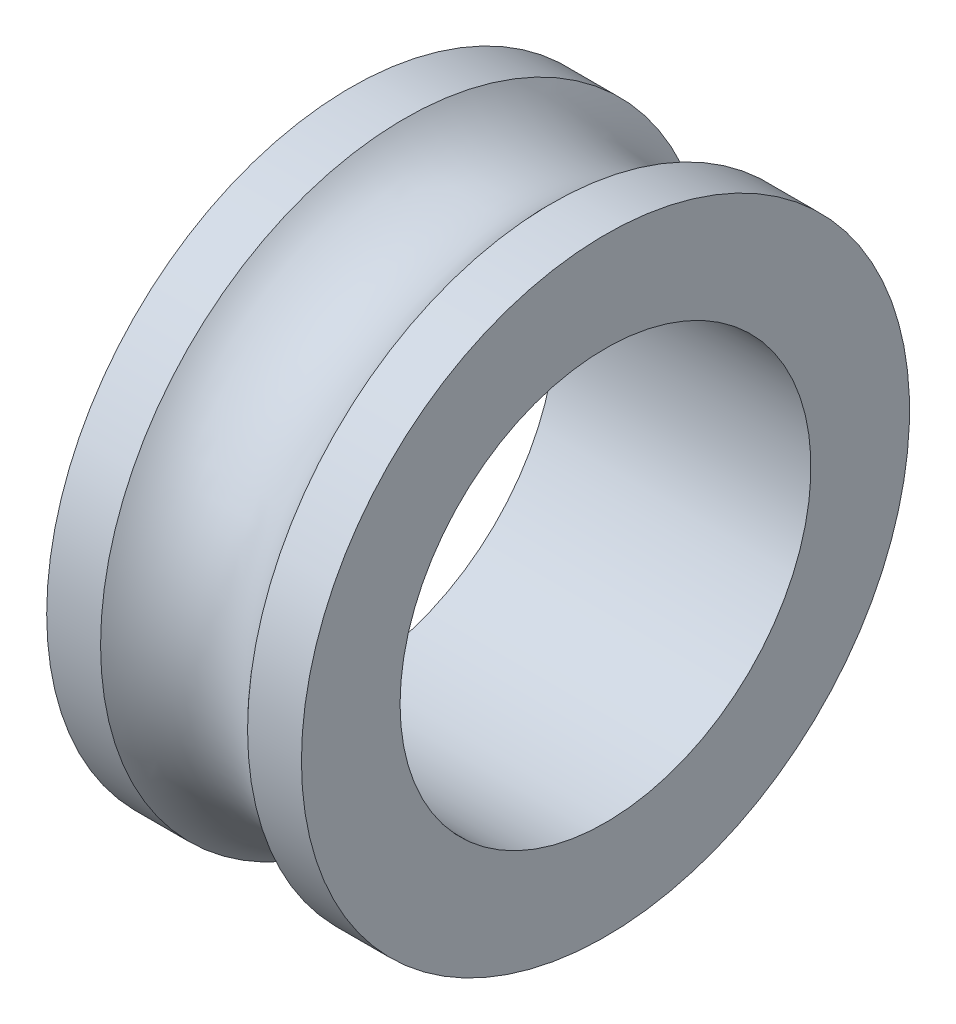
ISO-10303-21;
HEADER;
FILE_DESCRIPTION(('STEP AP214'),'2;1');
FILE_NAME('part.step','',(''),(''),'','','');
FILE_SCHEMA(('AUTOMOTIVE_DESIGN { 1 0 10303 214 1 1 1 1 }'));
ENDSEC;
DATA;
#1=APPLICATION_CONTEXT('core data for automotive mechanical design processes');
#2=APPLICATION_PROTOCOL_DEFINITION('international standard','automotive_design',2000,#1);
#3=PRODUCT_CONTEXT('',#1,'mechanical');
#4=PRODUCT('Part','Part','',(#3));
#5=PRODUCT_RELATED_PRODUCT_CATEGORY('part','',(#4));
#6=PRODUCT_DEFINITION_FORMATION('','',#4);
#7=PRODUCT_DEFINITION_CONTEXT('part definition',#1,'design');
#8=PRODUCT_DEFINITION('design','',#6,#7);
#9=PRODUCT_DEFINITION_SHAPE('','',#8);
#10=(LENGTH_UNIT() NAMED_UNIT(*) SI_UNIT(.MILLI.,.METRE.));
#11=(NAMED_UNIT(*) PLANE_ANGLE_UNIT() SI_UNIT($,.RADIAN.));
#12=(NAMED_UNIT(*) SI_UNIT($,.STERADIAN.) SOLID_ANGLE_UNIT());
#13=UNCERTAINTY_MEASURE_WITH_UNIT(LENGTH_MEASURE(1.E-05),#10,'distance_accuracy_value','');
#14=(GEOMETRIC_REPRESENTATION_CONTEXT(3) GLOBAL_UNCERTAINTY_ASSIGNED_CONTEXT((#13)) GLOBAL_UNIT_ASSIGNED_CONTEXT((#10,
#11,#12)) REPRESENTATION_CONTEXT('',''));
#15=CARTESIAN_POINT('',(0.,0.,0.));
#16=DIRECTION('',(0.,0.,1.));
#17=DIRECTION('',(1.,0.,0.));
#18=AXIS2_PLACEMENT_3D('',#15,#16,#17);
#19=CARTESIAN_POINT('',(-14.4203980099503,0.,0.));
#20=DIRECTION('',(-1.,0.,0.));
#21=DIRECTION('',(0.,0.,1.));
#22=AXIS2_PLACEMENT_3D('',#19,#20,#21);
#23=CYLINDRICAL_SURFACE('',#22,37.);
#24=CARTESIAN_POINT('',(8.94427190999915,0.,0.));
#25=DIRECTION('',(-1.,0.,0.));
#26=DIRECTION('',(0.,0.,1.));
#27=AXIS2_PLACEMENT_3D('',#24,#25,#26);
#28=CIRCLE('',#27,37.);
#29=CARTESIAN_POINT('',(8.94427190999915,0.,37.));
#30=VERTEX_POINT('',#29);
#31=EDGE_CURVE('E10',#30,#30,#28,.T.);
#32=ORIENTED_EDGE('',*,*,#31,.F.);
#33=EDGE_LOOP('',(#32));
#34=FACE_BOUND('',#33,.T.);
#35=CARTESIAN_POINT('',(15.5,0.,0.));
#36=DIRECTION('',(-1.,0.,0.));
#37=DIRECTION('',(0.,0.,1.));
#38=AXIS2_PLACEMENT_3D('',#35,#36,#37);
#39=CIRCLE('',#38,37.);
#40=CARTESIAN_POINT('',(15.5,0.,37.));
#41=VERTEX_POINT('',#40);
#42=EDGE_CURVE('E55',#41,#41,#39,.T.);
#43=ORIENTED_EDGE('',*,*,#42,.T.);
#44=EDGE_LOOP('',(#43));
#45=FACE_BOUND('',#44,.T.);
#46=ADVANCED_FACE('F33',(#34,#45),#23,.T.);
#47=CARTESIAN_POINT('',(0.,0.,0.));
#48=DIRECTION('',(-1.,0.,0.));
#49=DIRECTION('',(0.,0.,1.));
#50=AXIS2_PLACEMENT_3D('',#47,#48,#49);
#51=TOROIDAL_SURFACE('',#50,45.,12.);
#52=CARTESIAN_POINT('',(-8.94427190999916,0.,0.));
#53=DIRECTION('',(-1.,0.,0.));
#54=DIRECTION('',(0.,0.,1.));
#55=AXIS2_PLACEMENT_3D('',#52,#53,#54);
#56=CIRCLE('',#55,37.);
#57=CARTESIAN_POINT('',(-8.94427190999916,0.,37.));
#58=VERTEX_POINT('',#57);
#59=EDGE_CURVE('E39',#58,#58,#56,.T.);
#60=ORIENTED_EDGE('',*,*,#59,.F.);
#61=EDGE_LOOP('',(#60));
#62=FACE_BOUND('',#61,.T.);
#63=ORIENTED_EDGE('',*,*,#31,.T.);
#64=EDGE_LOOP('',(#63));
#65=FACE_BOUND('',#64,.T.);
#66=ADVANCED_FACE('F80',(#62,#65),#51,.F.);
#67=CARTESIAN_POINT('',(-14.4203980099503,0.,0.));
#68=DIRECTION('',(-1.,0.,0.));
#69=DIRECTION('',(0.,0.,1.));
#70=AXIS2_PLACEMENT_3D('',#67,#68,#69);
#71=CYLINDRICAL_SURFACE('',#70,37.);
#72=CARTESIAN_POINT('',(-15.5,0.,0.));
#73=DIRECTION('',(-1.,0.,0.));
#74=DIRECTION('',(0.,0.,1.));
#75=AXIS2_PLACEMENT_3D('',#72,#73,#74);
#76=CIRCLE('',#75,37.);
#77=CARTESIAN_POINT('',(-15.5,0.,37.));
#78=VERTEX_POINT('',#77);
#79=EDGE_CURVE('E43',#78,#78,#76,.T.);
#80=ORIENTED_EDGE('',*,*,#79,.F.);
#81=EDGE_LOOP('',(#80));
#82=FACE_BOUND('',#81,.T.);
#83=ORIENTED_EDGE('',*,*,#59,.T.);
#84=EDGE_LOOP('',(#83));
#85=FACE_BOUND('',#84,.T.);
#86=ADVANCED_FACE('F75',(#82,#85),#71,.T.);
#87=CARTESIAN_POINT('',(-15.5,25.,0.));
#88=DIRECTION('',(1.,0.,0.));
#89=DIRECTION('',(0.,0.,-1.));
#90=AXIS2_PLACEMENT_3D('',#87,#88,#89);
#91=PLANE('',#90);
#92=CARTESIAN_POINT('',(-15.5,0.,0.));
#93=DIRECTION('',(-1.,0.,0.));
#94=DIRECTION('',(0.,0.,1.));
#95=AXIS2_PLACEMENT_3D('',#92,#93,#94);
#96=CIRCLE('',#95,25.);
#97=CARTESIAN_POINT('',(-15.5,0.,25.));
#98=VERTEX_POINT('',#97);
#99=EDGE_CURVE('E47',#98,#98,#96,.T.);
#100=ORIENTED_EDGE('',*,*,#99,.F.);
#101=EDGE_LOOP('',(#100));
#102=FACE_BOUND('',#101,.T.);
#103=ORIENTED_EDGE('',*,*,#79,.T.);
#104=EDGE_LOOP('',(#103));
#105=FACE_BOUND('',#104,.T.);
#106=ADVANCED_FACE('F69',(#102,#105),#91,.F.);
#107=CARTESIAN_POINT('',(-14.4203980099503,0.,0.));
#108=DIRECTION('',(-1.,0.,0.));
#109=DIRECTION('',(0.,0.,1.));
#110=AXIS2_PLACEMENT_3D('',#107,#108,#109);
#111=CYLINDRICAL_SURFACE('',#110,25.);
#112=CARTESIAN_POINT('',(15.5,0.,0.));
#113=DIRECTION('',(-1.,0.,0.));
#114=DIRECTION('',(0.,0.,1.));
#115=AXIS2_PLACEMENT_3D('',#112,#113,#114);
#116=CIRCLE('',#115,25.);
#117=CARTESIAN_POINT('',(15.5,0.,25.));
#118=VERTEX_POINT('',#117);
#119=EDGE_CURVE('E52',#118,#118,#116,.T.);
#120=ORIENTED_EDGE('',*,*,#119,.F.);
#121=EDGE_LOOP('',(#120));
#122=FACE_BOUND('',#121,.T.);
#123=ORIENTED_EDGE('',*,*,#99,.T.);
#124=EDGE_LOOP('',(#123));
#125=FACE_BOUND('',#124,.T.);
#126=ADVANCED_FACE('F63',(#122,#125),#111,.F.);
#127=CARTESIAN_POINT('',(15.5,25.,0.));
#128=DIRECTION('',(-1.,0.,0.));
#129=DIRECTION('',(0.,0.,1.));
#130=AXIS2_PLACEMENT_3D('',#127,#128,#129);
#131=PLANE('',#130);
#132=ORIENTED_EDGE('',*,*,#42,.F.);
#133=EDGE_LOOP('',(#132));
#134=FACE_BOUND('',#133,.T.);
#135=ORIENTED_EDGE('',*,*,#119,.T.);
#136=EDGE_LOOP('',(#135));
#137=FACE_BOUND('',#136,.T.);
#138=ADVANCED_FACE('F60',(#134,#137),#131,.F.);
#139=CLOSED_SHELL('',(#46,#66,#86,#106,#126,#138));
#140=MANIFOLD_SOLID_BREP('B2',#139);
#141=ADVANCED_BREP_SHAPE_REPRESENTATION('',(#18,#140),#14);
#142=SHAPE_DEFINITION_REPRESENTATION(#9,#141);
ENDSEC;
END-ISO-10303-21;
